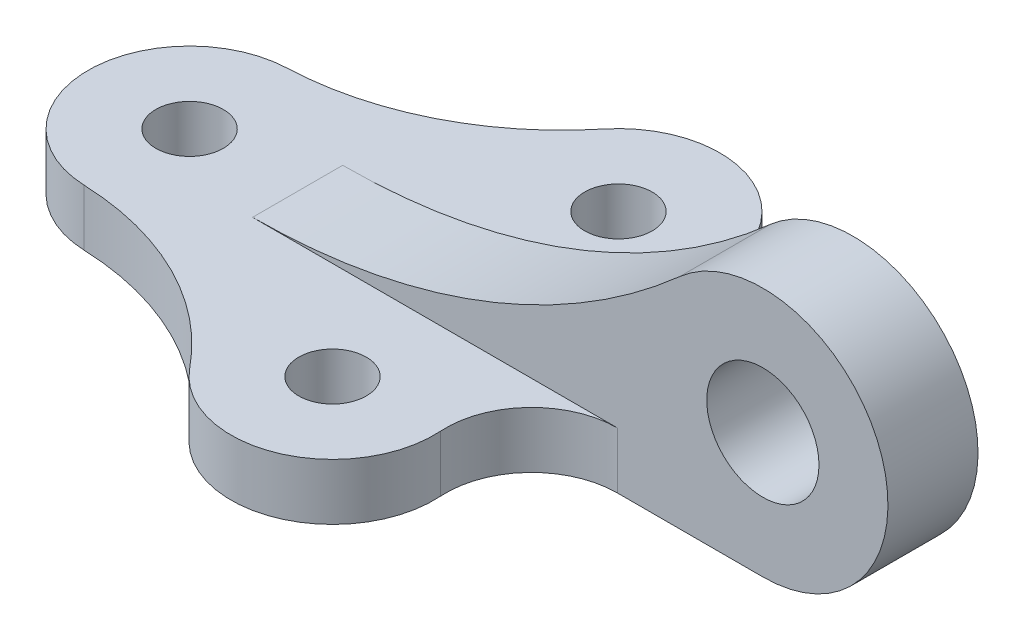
from build123d import *

# Parameters (mm, degrees)
SKETCH1_R                = 5.9944
BOSS_EXTRUDE1_DEPTH      = 10.0076
BOSS_EXTRUDE2_DEPTH      = 8.001
BOSS_EXTRUDE2_DEPTH_BACK = 8.001
SKETCH2_R                = 9.9695


with BuildPart() as part:
    # Sketch1 → Boss-Extrude1 (new body)
    with BuildSketch(Plane(origin=(0, 0, 0), x_dir=(1, 0, 0), z_dir=(0, 1, 0))):
        with BuildLine():
            Line((84.003882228, 8.001), (84.003882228, -8.001))
            ThreePointArc((84.003882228, -8.001), (72.88345621, -12.82016869), (68.795997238, -24.229854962))
            ThreePointArc((68.795997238, -24.229854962), (57.378658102, -42.191260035), (36.798683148, -36.76610234))
            ThreePointArc((36.798683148, -36.76610234), (20.076804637, -23.346390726), (-0.69209176, -18.020714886))
            ThreePointArc((-0.69209176, -18.020714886), (-18.034, 0), (-0.69209176, 18.020714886))
            ThreePointArc((-0.69209176, 18.020714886), (20.076804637, 23.346390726), (36.798683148, 36.76610234))
            ThreePointArc((36.798683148, 36.76610234), (57.378658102, 42.191260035), (68.795997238, 24.229854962))
            ThreePointArc((68.795997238, 24.229854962), (72.88345621, 12.82016869), (84.003882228, 8.001))
        make_face()
        with Locations(Location((0, 0, 0), (0, 0, 270))):
            Circle(SKETCH1_R, mode=Mode.SUBTRACT)
        with Locations(Location((50.8, 25.4, 0), (0, 0, 270))):
            Circle(SKETCH1_R, mode=Mode.SUBTRACT)
        with Locations(Location((50.8, -25.4, 0), (0, 0, 90))):
            Circle(SKETCH1_R, mode=Mode.SUBTRACT)
    extrude(amount=BOSS_EXTRUDE1_DEPTH)

    # Sketch2 → Boss-Extrude2 (add, two sides: drawn at the far end of the back side and taken through both)
    with BuildSketch(Plane.XY.offset(-BOSS_EXTRUDE2_DEPTH_BACK)):
        with BuildLine():
            Line((19.200610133, 10.0076), (19.200610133, 0))
            Line((19.200610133, 0), (109.855, 0))
            ThreePointArc((109.855, 0), (130.631042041, 30.11845945), (95.097308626, 38.843097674))
            ThreePointArc((95.097308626, 38.843097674), (59.795544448, 17.459383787), (19.200610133, 10.0076))
        make_face()
        with Locations((109.855, 22.225)):
            Circle(SKETCH2_R, mode=Mode.SUBTRACT)
    extrude(amount=BOSS_EXTRUDE2_DEPTH + BOSS_EXTRUDE2_DEPTH_BACK)


solid = part.part
